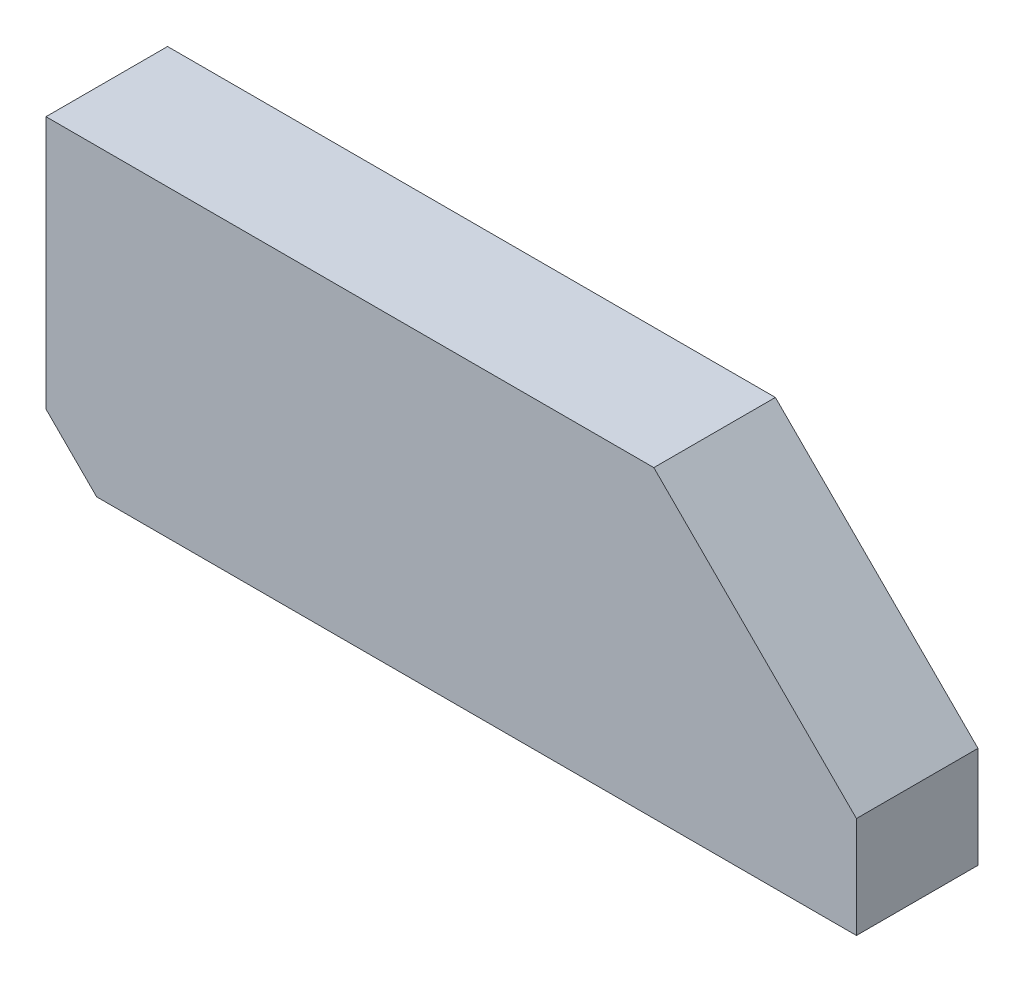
from build123d import *

# Parameters (mm, degrees)
BASE_EXTRUSION_DEPTH = 12


with BuildPart() as part:
    # Esquisse1 → Base-Extrusion (new body)
    with BuildSketch(Plane.XY):
        Polygon((60, 0), (80, -20), (80, -30), (5, -30), (0, -25), (0, 0), align=None)
    extrude(amount=-BASE_EXTRUSION_DEPTH)


solid = part.part
